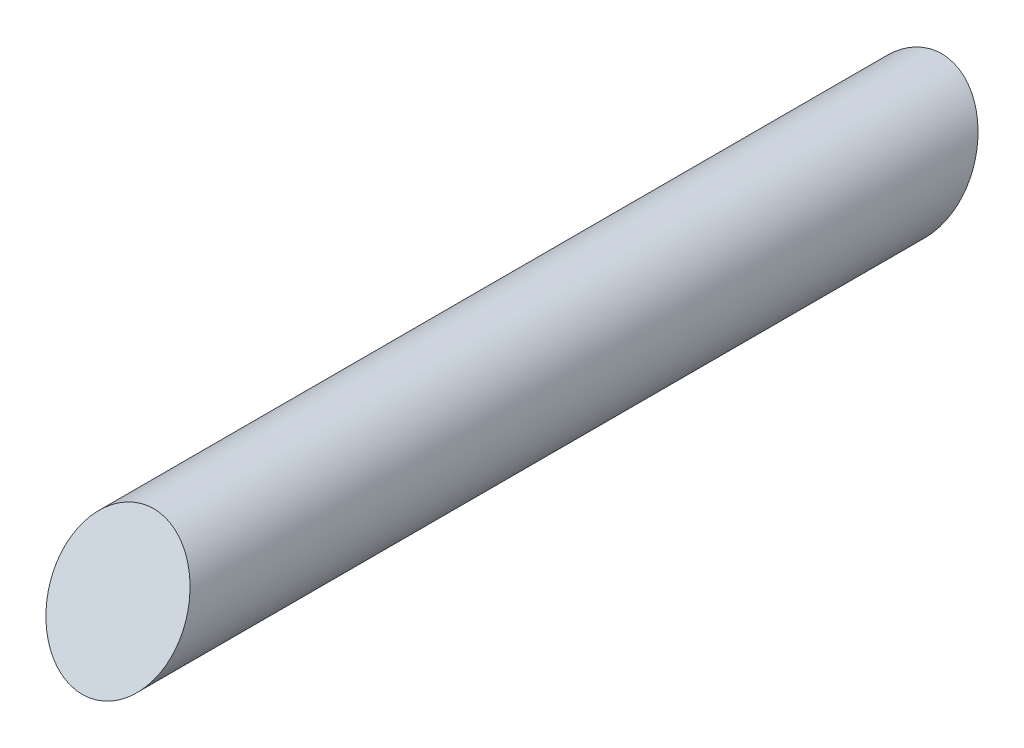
from build123d import *

# Parameters (mm, degrees)
SKETCH1_R               = 38.408073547
EXTRUDE1_DEPTH          = 527.558
CUT_EXTRUDE1_DEPTH      = 531.346871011
CUT_EXTRUDE1_DEPTH_BACK = 531.346871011
SKETCH2_OUTSIDE_W       = 637.284
SKETCH2_OUTSIDE_H       = 186.542


with BuildPart() as part:
    # Sketch1 → Extrude1 (new body)
    with BuildSketch(Plane.XY):
        Circle(SKETCH1_R)
    extrude(amount=EXTRUDE1_DEPTH)

    # Sketch2 outside → Cut-Extrude1 (cut, two sides: drawn at the far end of the back side and taken through both)
    with BuildSketch(Plane(origin=(0, 0, 0), x_dir=(0, 0, -1), z_dir=(1, 0, 0)).offset(-CUT_EXTRUDE1_DEPTH_BACK)):
        with Locations((-263.779, 0)):
            Rectangle(SKETCH2_OUTSIDE_W, SKETCH2_OUTSIDE_H)
        Polygon((-527.558, -38.408073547), (-483.694252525, 38.408073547), (0, 38.408073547), (-43.863747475, -38.408073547), align=None, mode=Mode.SUBTRACT)
    extrude(amount=CUT_EXTRUDE1_DEPTH + CUT_EXTRUDE1_DEPTH_BACK, mode=Mode.SUBTRACT)


solid = part.part
